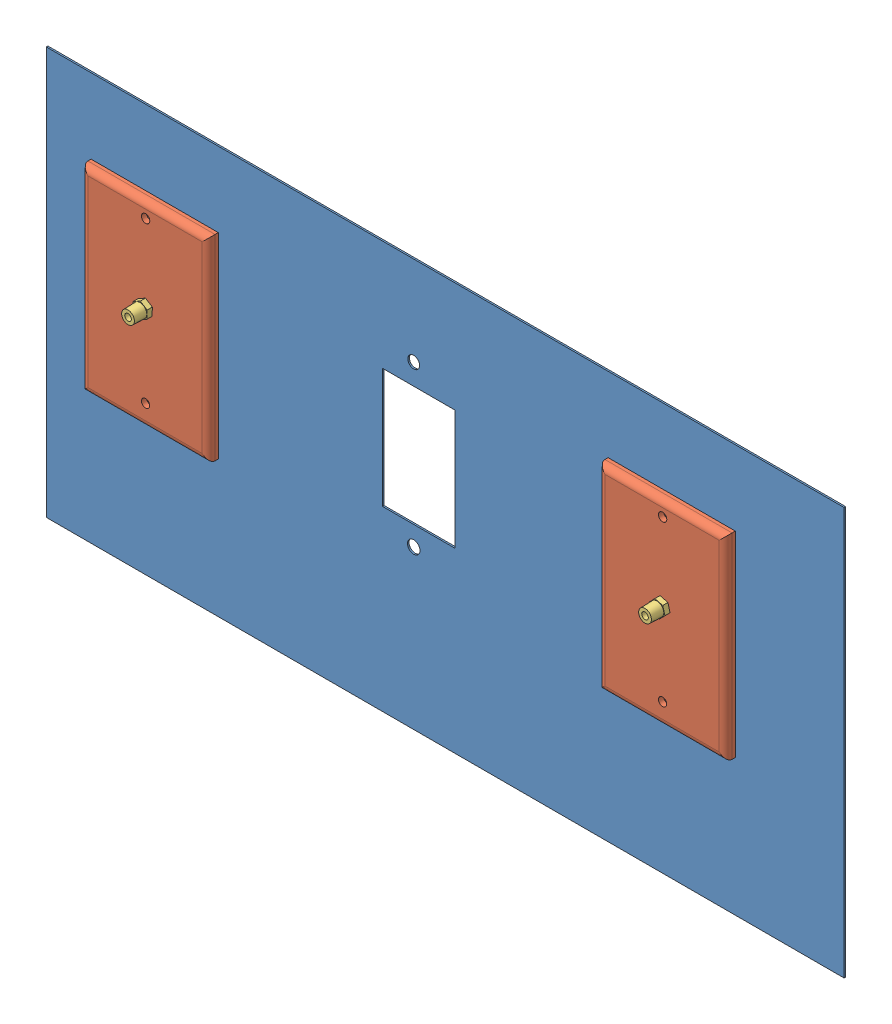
SolidWorks assembly WallPlates.SLDASM, configuration Default (file format 3400). Lengths in mm.
Overall size (1261.97 644.6 59.02).
5 component instances, 3 part files, 10 mates.
Components (placement in the parent):
- Panel-1: Panel.SLDPRT [Default] at origin size (1261.97 644.6 2.54)
- WallPlate-1: WallPlate.SLDPRT [Default] at (710.1321 23.6153 2.54) size (201.23 310.31 15.24)
- WallPlate-2: WallPlate.SLDPRT [Default] at (-107.7479 23.6153 2.54) size (201.23 310.31 15.24)
- tubing connector-None: tubing connector.sldprt [MALE CONNECTOR-0.500Tx0.500 NPT] at (-120.6834 23.6153 45.5676) x (0 0 1) z (-0.878611 -0.477538 0) size (59.02 22.23 25.66)
- tubing connector-2: tubing connector.sldprt [MALE CONNECTOR-0.500Tx0.500 NPT] at (697.1966 23.6153 45.5676) x (0 0 1) z (-0.269697 0.962945 0) size (59.02 22.23 25.66)
Mates (geometry in assembly coordinates):
- Coincident1: coincident anti-aligned: plane of Panel-1 through (-292.9346 -1002.7914 2.54) normal (0 0 1); plane of WallPlate-1 through (595.703 -142.2564 2.54) normal (0 0 -1)
- Concentric2: concentric aligned: cylinder of Panel-1; cylinder of WallPlate-2
- Coincident2: coincident anti-aligned: plane of Panel-1 through (-292.9346 -1002.7914 2.54) normal (0 0 1); plane of WallPlate-2 through (-222.177 -142.2564 2.54) normal (0 0 -1)
- Concentric5: concentric aligned: circle of Panel-1; circle of WallPlate-2
- Concentric9: concentric aligned: cylinder of Panel-1; cylinder of WallPlate-1
- Concentric12: concentric aligned: unknown of WallPlate-2
- Coincident5: coincident aligned: unknown of WallPlate-2
- Concentric13: concentric aligned: unknown of WallPlate-1
- Concentric14: concentric aligned: circle of Panel-1; circle of WallPlate-1
- Coincident6: coincident aligned: unknown of WallPlate-1
